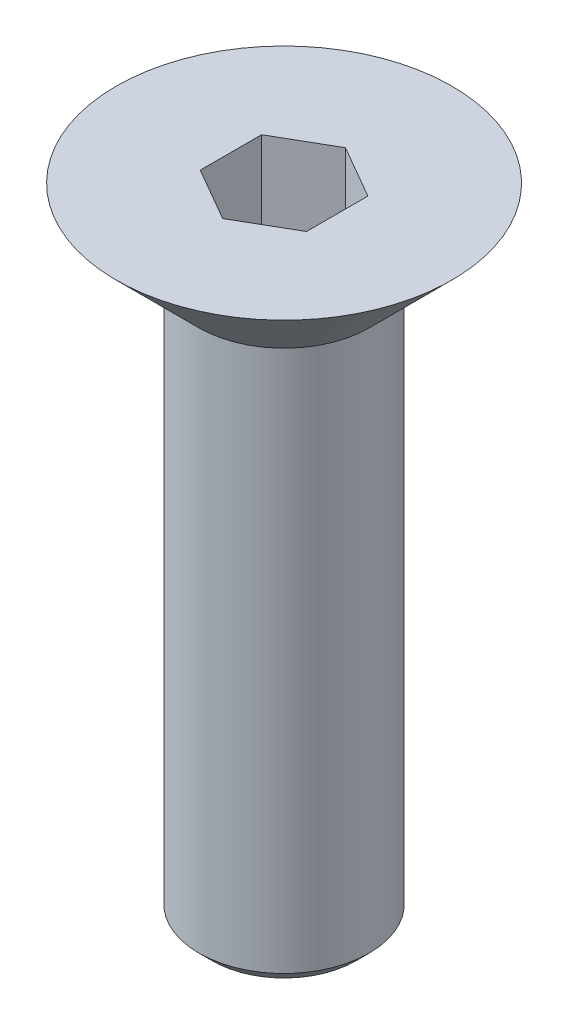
ISO-10303-21;
HEADER;
FILE_DESCRIPTION(('STEP AP214'),'2;1');
FILE_NAME('part.step','',(''),(''),'','','');
FILE_SCHEMA(('AUTOMOTIVE_DESIGN { 1 0 10303 214 1 1 1 1 }'));
ENDSEC;
DATA;
#1=APPLICATION_CONTEXT('core data for automotive mechanical design processes');
#2=APPLICATION_PROTOCOL_DEFINITION('international standard','automotive_design',2000,#1);
#3=PRODUCT_CONTEXT('',#1,'mechanical');
#4=PRODUCT('Part','Part','',(#3));
#5=PRODUCT_RELATED_PRODUCT_CATEGORY('part','',(#4));
#6=PRODUCT_DEFINITION_FORMATION('','',#4);
#7=PRODUCT_DEFINITION_CONTEXT('part definition',#1,'design');
#8=PRODUCT_DEFINITION('design','',#6,#7);
#9=PRODUCT_DEFINITION_SHAPE('','',#8);
#10=(LENGTH_UNIT() NAMED_UNIT(*) SI_UNIT(.MILLI.,.METRE.));
#11=(NAMED_UNIT(*) PLANE_ANGLE_UNIT() SI_UNIT($,.RADIAN.));
#12=(NAMED_UNIT(*) SI_UNIT($,.STERADIAN.) SOLID_ANGLE_UNIT());
#13=UNCERTAINTY_MEASURE_WITH_UNIT(LENGTH_MEASURE(1.E-05),#10,'distance_accuracy_value','');
#14=(GEOMETRIC_REPRESENTATION_CONTEXT(3) GLOBAL_UNCERTAINTY_ASSIGNED_CONTEXT((#13)) GLOBAL_UNIT_ASSIGNED_CONTEXT((#10,
#11,#12)) REPRESENTATION_CONTEXT('',''));
#15=CARTESIAN_POINT('',(0.,0.,0.));
#16=DIRECTION('',(0.,0.,1.));
#17=DIRECTION('',(1.,0.,0.));
#18=AXIS2_PLACEMENT_3D('',#15,#16,#17);
#19=CARTESIAN_POINT('',(0.,0.,0.));
#20=DIRECTION('',(0.,1.,0.));
#21=DIRECTION('',(-1.,0.,0.));
#22=AXIS2_PLACEMENT_3D('',#19,#20,#21);
#23=PLANE('',#22);
#24=DIRECTION('',(0.866025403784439,0.,-0.5));
#25=VECTOR('',#24,1.);
#26=CARTESIAN_POINT('',(0.,0.,2.88675134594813));
#27=LINE('',#26,#25);
#28=CARTESIAN_POINT('',(0.,0.,2.88675134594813));
#29=VERTEX_POINT('',#28);
#30=CARTESIAN_POINT('',(2.5,0.,1.44337567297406));
#31=VERTEX_POINT('',#30);
#32=EDGE_CURVE('E46',#29,#31,#27,.T.);
#33=ORIENTED_EDGE('',*,*,#32,.F.);
#34=DIRECTION('',(-0.866025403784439,0.,-0.5));
#35=VECTOR('',#34,1.);
#36=CARTESIAN_POINT('',(0.,0.,2.88675134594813));
#37=LINE('',#36,#35);
#38=CARTESIAN_POINT('',(-2.5,0.,1.44337567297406));
#39=VERTEX_POINT('',#38);
#40=EDGE_CURVE('E114',#29,#39,#37,.T.);
#41=ORIENTED_EDGE('',*,*,#40,.T.);
#42=DIRECTION('',(0.,0.,-1.));
#43=VECTOR('',#42,1.);
#44=CARTESIAN_POINT('',(-2.5,0.,1.44337567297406));
#45=LINE('',#44,#43);
#46=CARTESIAN_POINT('',(-2.5,0.,-1.44337567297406));
#47=VERTEX_POINT('',#46);
#48=EDGE_CURVE('E109',#39,#47,#45,.T.);
#49=ORIENTED_EDGE('',*,*,#48,.T.);
#50=DIRECTION('',(0.866025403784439,0.,-0.5));
#51=VECTOR('',#50,1.);
#52=CARTESIAN_POINT('',(-2.5,0.,-1.44337567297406));
#53=LINE('',#52,#51);
#54=CARTESIAN_POINT('',(0.,0.,-2.88675134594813));
#55=VERTEX_POINT('',#54);
#56=EDGE_CURVE('E107',#47,#55,#53,.T.);
#57=ORIENTED_EDGE('',*,*,#56,.T.);
#58=DIRECTION('',(-0.866025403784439,0.,-0.5));
#59=VECTOR('',#58,1.);
#60=CARTESIAN_POINT('',(2.5,0.,-1.44337567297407));
#61=LINE('',#60,#59);
#62=CARTESIAN_POINT('',(2.5,0.,-1.44337567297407));
#63=VERTEX_POINT('',#62);
#64=EDGE_CURVE('E89',#63,#55,#61,.T.);
#65=ORIENTED_EDGE('',*,*,#64,.F.);
#66=DIRECTION('',(0.,0.,-1.));
#67=VECTOR('',#66,1.);
#68=CARTESIAN_POINT('',(2.5,0.,1.44337567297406));
#69=LINE('',#68,#67);
#70=EDGE_CURVE('E100',#31,#63,#69,.T.);
#71=ORIENTED_EDGE('',*,*,#70,.F.);
#72=EDGE_LOOP('',(#33,#41,#49,#57,#65,#71));
#73=FACE_BOUND('',#72,.T.);
#74=CARTESIAN_POINT('',(0.,0.,0.));
#75=DIRECTION('',(0.,1.,0.));
#76=DIRECTION('',(-1.,0.,0.));
#77=AXIS2_PLACEMENT_3D('',#74,#75,#76);
#78=CIRCLE('',#77,7.89999999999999);
#79=CARTESIAN_POINT('',(-7.89999999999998,0.,0.));
#80=VERTEX_POINT('',#79);
#81=EDGE_CURVE('E139',#80,#80,#78,.T.);
#82=ORIENTED_EDGE('',*,*,#81,.T.);
#83=EDGE_LOOP('',(#82));
#84=FACE_BOUND('',#83,.T.);
#85=ADVANCED_FACE('F32',(#73,#84),#23,.T.);
#86=CARTESIAN_POINT('',(0.,0.,0.));
#87=DIRECTION('',(0.,1.,0.));
#88=DIRECTION('',(-1.,0.,0.));
#89=AXIS2_PLACEMENT_3D('',#86,#87,#88);
#90=CONICAL_SURFACE('',#89,7.89999999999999,0.78539816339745);
#91=CARTESIAN_POINT('',(0.,-3.89999999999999,0.));
#92=DIRECTION('',(0.,1.,0.));
#93=DIRECTION('',(-1.,0.,0.));
#94=AXIS2_PLACEMENT_3D('',#91,#92,#93);
#95=CIRCLE('',#94,3.99999999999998);
#96=CARTESIAN_POINT('',(-3.99999999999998,-3.89999999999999,0.));
#97=VERTEX_POINT('',#96);
#98=EDGE_CURVE('E130',#97,#97,#95,.T.);
#99=ORIENTED_EDGE('',*,*,#98,.T.);
#100=EDGE_LOOP('',(#99));
#101=FACE_BOUND('',#100,.T.);
#102=ORIENTED_EDGE('',*,*,#81,.F.);
#103=EDGE_LOOP('',(#102));
#104=FACE_BOUND('',#103,.T.);
#105=ADVANCED_FACE('F159',(#101,#104),#90,.T.);
#106=CARTESIAN_POINT('',(0.,65.1172922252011,0.));
#107=DIRECTION('',(0.,1.,0.));
#108=DIRECTION('',(-1.,0.,0.));
#109=AXIS2_PLACEMENT_3D('',#106,#107,#108);
#110=CYLINDRICAL_SURFACE('',#109,3.99999999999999);
#111=CARTESIAN_POINT('',(0.,-29.375,0.));
#112=DIRECTION('',(0.,-1.,0.));
#113=DIRECTION('',(1.,0.,0.));
#114=AXIS2_PLACEMENT_3D('',#111,#112,#113);
#115=CIRCLE('',#114,3.99999999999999);
#116=CARTESIAN_POINT('',(4.,-29.375,0.));
#117=VERTEX_POINT('',#116);
#118=EDGE_CURVE('E39',#117,#117,#115,.F.);
#119=ORIENTED_EDGE('',*,*,#118,.T.);
#120=EDGE_LOOP('',(#119));
#121=FACE_BOUND('',#120,.T.);
#122=ORIENTED_EDGE('',*,*,#98,.F.);
#123=EDGE_LOOP('',(#122));
#124=FACE_BOUND('',#123,.T.);
#125=ADVANCED_FACE('F144',(#121,#124),#110,.T.);
#126=CARTESIAN_POINT('',(4.00000000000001,-30.,0.));
#127=DIRECTION('',(0.,-1.,0.));
#128=DIRECTION('',(1.,0.,0.));
#129=AXIS2_PLACEMENT_3D('',#126,#127,#128);
#130=PLANE('',#129);
#131=CARTESIAN_POINT('',(0.,-30.,0.));
#132=DIRECTION('',(0.,-1.,0.));
#133=DIRECTION('',(1.,0.,0.));
#134=AXIS2_PLACEMENT_3D('',#131,#132,#133);
#135=CIRCLE('',#134,3.37499999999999);
#136=CARTESIAN_POINT('',(3.375,-30.,0.));
#137=VERTEX_POINT('',#136);
#138=EDGE_CURVE('E11',#137,#137,#135,.T.);
#139=ORIENTED_EDGE('',*,*,#138,.T.);
#140=EDGE_LOOP('',(#139));
#141=FACE_BOUND('',#140,.T.);
#142=ADVANCED_FACE('F167',(#141),#130,.T.);
#143=CARTESIAN_POINT('',(0.,-7.2,2.88675134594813));
#144=DIRECTION('',(0.5,0.,0.866025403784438));
#145=DIRECTION('',(0.866025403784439,0.,-0.5));
#146=AXIS2_PLACEMENT_3D('',#143,#144,#145);
#147=PLANE('',#146);
#148=ORIENTED_EDGE('',*,*,#32,.T.);
#149=DIRECTION('',(0.,1.,0.));
#150=VECTOR('',#149,1.);
#151=CARTESIAN_POINT('',(2.5,-7.2,1.44337567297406));
#152=LINE('',#151,#150);
#153=CARTESIAN_POINT('',(2.5,-7.2,1.44337567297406));
#154=VERTEX_POINT('',#153);
#155=EDGE_CURVE('E97',#154,#31,#152,.T.);
#156=ORIENTED_EDGE('',*,*,#155,.F.);
#157=DIRECTION('',(0.866025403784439,0.,-0.5));
#158=VECTOR('',#157,1.);
#159=CARTESIAN_POINT('',(0.,-7.2,2.88675134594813));
#160=LINE('',#159,#158);
#161=CARTESIAN_POINT('',(0.,-7.2,2.88675134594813));
#162=VERTEX_POINT('',#161);
#163=EDGE_CURVE('E117',#162,#154,#160,.T.);
#164=ORIENTED_EDGE('',*,*,#163,.F.);
#165=DIRECTION('',(0.,1.,0.));
#166=VECTOR('',#165,1.);
#167=CARTESIAN_POINT('',(0.,-7.2,2.88675134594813));
#168=LINE('',#167,#166);
#169=EDGE_CURVE('E53',#162,#29,#168,.T.);
#170=ORIENTED_EDGE('',*,*,#169,.T.);
#171=EDGE_LOOP('',(#148,#156,#164,#170));
#172=FACE_BOUND('',#171,.T.);
#173=ADVANCED_FACE('F173',(#172),#147,.F.);
#174=CARTESIAN_POINT('',(0.,-7.2,2.88675134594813));
#175=DIRECTION('',(0.5,0.,-0.866025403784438));
#176=DIRECTION('',(-0.866025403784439,0.,-0.5));
#177=AXIS2_PLACEMENT_3D('',#174,#175,#176);
#178=PLANE('',#177);
#179=ORIENTED_EDGE('',*,*,#40,.F.);
#180=ORIENTED_EDGE('',*,*,#169,.F.);
#181=DIRECTION('',(-0.866025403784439,0.,-0.5));
#182=VECTOR('',#181,1.);
#183=CARTESIAN_POINT('',(0.,-7.2,2.88675134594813));
#184=LINE('',#183,#182);
#185=CARTESIAN_POINT('',(-2.5,-7.2,1.44337567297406));
#186=VERTEX_POINT('',#185);
#187=EDGE_CURVE('E127',#162,#186,#184,.T.);
#188=ORIENTED_EDGE('',*,*,#187,.T.);
#189=DIRECTION('',(0.,1.,0.));
#190=VECTOR('',#189,1.);
#191=CARTESIAN_POINT('',(-2.5,-7.2,1.44337567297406));
#192=LINE('',#191,#190);
#193=EDGE_CURVE('E131',#186,#39,#192,.T.);
#194=ORIENTED_EDGE('',*,*,#193,.T.);
#195=EDGE_LOOP('',(#179,#180,#188,#194));
#196=FACE_BOUND('',#195,.T.);
#197=ADVANCED_FACE('F177',(#196),#178,.T.);
#198=CARTESIAN_POINT('',(-2.5,-7.2,1.44337567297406));
#199=DIRECTION('',(1.,0.,0.));
#200=DIRECTION('',(0.,1.,0.));
#201=AXIS2_PLACEMENT_3D('',#198,#199,#200);
#202=PLANE('',#201);
#203=ORIENTED_EDGE('',*,*,#48,.F.);
#204=ORIENTED_EDGE('',*,*,#193,.F.);
#205=DIRECTION('',(0.,0.,-1.));
#206=VECTOR('',#205,1.);
#207=CARTESIAN_POINT('',(-2.5,-7.2,1.44337567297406));
#208=LINE('',#207,#206);
#209=CARTESIAN_POINT('',(-2.5,-7.2,-1.44337567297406));
#210=VERTEX_POINT('',#209);
#211=EDGE_CURVE('E125',#186,#210,#208,.T.);
#212=ORIENTED_EDGE('',*,*,#211,.T.);
#213=DIRECTION('',(0.,1.,0.));
#214=VECTOR('',#213,1.);
#215=CARTESIAN_POINT('',(-2.5,-7.2,-1.44337567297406));
#216=LINE('',#215,#214);
#217=EDGE_CURVE('E133',#210,#47,#216,.T.);
#218=ORIENTED_EDGE('',*,*,#217,.T.);
#219=EDGE_LOOP('',(#203,#204,#212,#218));
#220=FACE_BOUND('',#219,.T.);
#221=ADVANCED_FACE('F185',(#220),#202,.T.);
#222=CARTESIAN_POINT('',(-2.5,-7.2,-1.44337567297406));
#223=DIRECTION('',(0.5,0.,0.866025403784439));
#224=DIRECTION('',(0.866025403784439,0.,-0.5));
#225=AXIS2_PLACEMENT_3D('',#222,#223,#224);
#226=PLANE('',#225);
#227=ORIENTED_EDGE('',*,*,#56,.F.);
#228=ORIENTED_EDGE('',*,*,#217,.F.);
#229=DIRECTION('',(0.866025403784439,0.,-0.5));
#230=VECTOR('',#229,1.);
#231=CARTESIAN_POINT('',(-2.5,-7.2,-1.44337567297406));
#232=LINE('',#231,#230);
#233=CARTESIAN_POINT('',(0.,-7.2,-2.88675134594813));
#234=VERTEX_POINT('',#233);
#235=EDGE_CURVE('E123',#210,#234,#232,.T.);
#236=ORIENTED_EDGE('',*,*,#235,.T.);
#237=DIRECTION('',(0.,1.,0.));
#238=VECTOR('',#237,1.);
#239=CARTESIAN_POINT('',(0.,-7.2,-2.88675134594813));
#240=LINE('',#239,#238);
#241=EDGE_CURVE('E96',#234,#55,#240,.T.);
#242=ORIENTED_EDGE('',*,*,#241,.T.);
#243=EDGE_LOOP('',(#227,#228,#236,#242));
#244=FACE_BOUND('',#243,.T.);
#245=ADVANCED_FACE('F182',(#244),#226,.T.);
#246=CARTESIAN_POINT('',(2.5,-7.2,-1.44337567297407));
#247=DIRECTION('',(0.5,0.,-0.866025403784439));
#248=DIRECTION('',(-0.866025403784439,0.,-0.5));
#249=AXIS2_PLACEMENT_3D('',#246,#247,#248);
#250=PLANE('',#249);
#251=ORIENTED_EDGE('',*,*,#64,.T.);
#252=ORIENTED_EDGE('',*,*,#241,.F.);
#253=DIRECTION('',(-0.866025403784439,0.,-0.5));
#254=VECTOR('',#253,1.);
#255=CARTESIAN_POINT('',(2.5,-7.2,-1.44337567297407));
#256=LINE('',#255,#254);
#257=CARTESIAN_POINT('',(2.5,-7.2,-1.44337567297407));
#258=VERTEX_POINT('',#257);
#259=EDGE_CURVE('E92',#258,#234,#256,.T.);
#260=ORIENTED_EDGE('',*,*,#259,.F.);
#261=DIRECTION('',(0.,1.,0.));
#262=VECTOR('',#261,1.);
#263=CARTESIAN_POINT('',(2.5,-7.2,-1.44337567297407));
#264=LINE('',#263,#262);
#265=EDGE_CURVE('E84',#258,#63,#264,.T.);
#266=ORIENTED_EDGE('',*,*,#265,.T.);
#267=EDGE_LOOP('',(#251,#252,#260,#266));
#268=FACE_BOUND('',#267,.T.);
#269=ADVANCED_FACE('F86',(#268),#250,.F.);
#270=CARTESIAN_POINT('',(2.5,-7.2,1.44337567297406));
#271=DIRECTION('',(1.,0.,0.));
#272=DIRECTION('',(0.,1.,0.));
#273=AXIS2_PLACEMENT_3D('',#270,#271,#272);
#274=PLANE('',#273);
#275=ORIENTED_EDGE('',*,*,#70,.T.);
#276=ORIENTED_EDGE('',*,*,#265,.F.);
#277=DIRECTION('',(0.,0.,-1.));
#278=VECTOR('',#277,1.);
#279=CARTESIAN_POINT('',(2.5,-7.2,1.44337567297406));
#280=LINE('',#279,#278);
#281=EDGE_CURVE('E120',#154,#258,#280,.T.);
#282=ORIENTED_EDGE('',*,*,#281,.F.);
#283=ORIENTED_EDGE('',*,*,#155,.T.);
#284=EDGE_LOOP('',(#275,#276,#282,#283));
#285=FACE_BOUND('',#284,.T.);
#286=ADVANCED_FACE('F101',(#285),#274,.F.);
#287=CARTESIAN_POINT('',(2.5,-7.2,1.44337567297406));
#288=DIRECTION('',(0.,1.,0.));
#289=DIRECTION('',(-1.,0.,0.));
#290=AXIS2_PLACEMENT_3D('',#287,#288,#289);
#291=PLANE('',#290);
#292=ORIENTED_EDGE('',*,*,#163,.T.);
#293=ORIENTED_EDGE('',*,*,#281,.T.);
#294=ORIENTED_EDGE('',*,*,#259,.T.);
#295=ORIENTED_EDGE('',*,*,#235,.F.);
#296=ORIENTED_EDGE('',*,*,#211,.F.);
#297=ORIENTED_EDGE('',*,*,#187,.F.);
#298=EDGE_LOOP('',(#292,#293,#294,#295,#296,#297));
#299=FACE_BOUND('',#298,.T.);
#300=ADVANCED_FACE('F149',(#299),#291,.T.);
#301=CARTESIAN_POINT('',(0.,-29.375,0.));
#302=DIRECTION('',(0.,1.,0.));
#303=DIRECTION('',(-1.,0.,0.));
#304=AXIS2_PLACEMENT_3D('',#301,#302,#303);
#305=CONICAL_SURFACE('',#304,3.99999999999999,0.78539816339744);
#306=ORIENTED_EDGE('',*,*,#138,.F.);
#307=EDGE_LOOP('',(#306));
#308=FACE_BOUND('',#307,.T.);
#309=ORIENTED_EDGE('',*,*,#118,.F.);
#310=EDGE_LOOP('',(#309));
#311=FACE_BOUND('',#310,.T.);
#312=ADVANCED_FACE('F147',(#308,#311),#305,.T.);
#313=CLOSED_SHELL('',(#85,#105,#125,#142,#173,#197,#221,#245,#269,#286,#300,#312));
#314=MANIFOLD_SOLID_BREP('B2',#313);
#315=ADVANCED_BREP_SHAPE_REPRESENTATION('',(#18,#314),#14);
#316=SHAPE_DEFINITION_REPRESENTATION(#9,#315);
ENDSEC;
END-ISO-10303-21;
